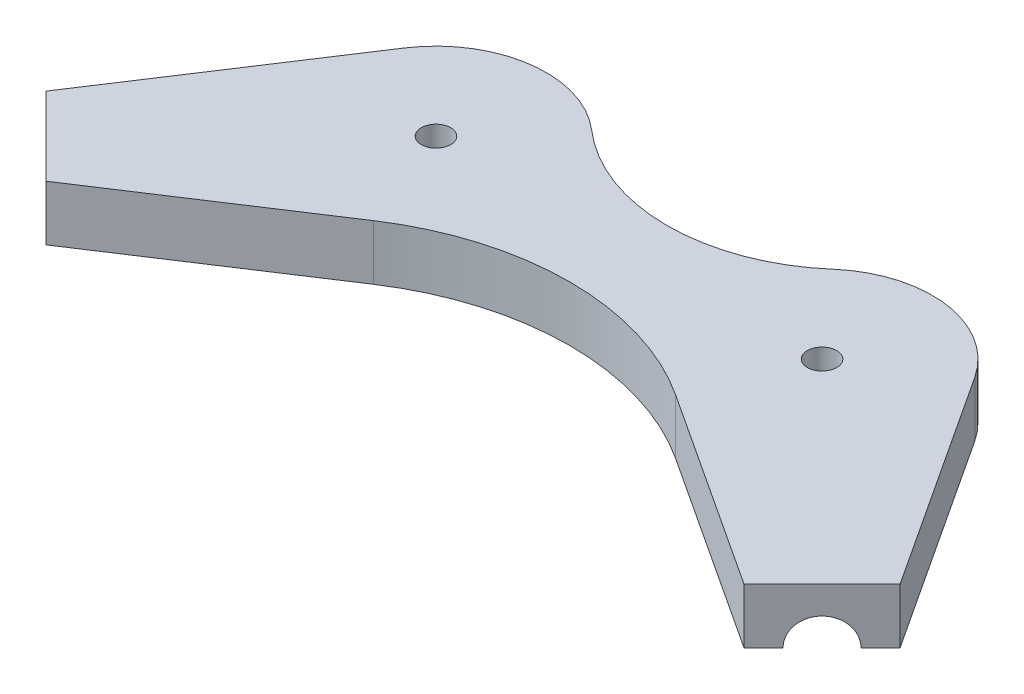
ISO-10303-21;
HEADER;
FILE_DESCRIPTION(('STEP AP214'),'2;1');
FILE_NAME('part.step','',(''),(''),'','','');
FILE_SCHEMA(('AUTOMOTIVE_DESIGN { 1 0 10303 214 1 1 1 1 }'));
ENDSEC;
DATA;
#1=APPLICATION_CONTEXT('core data for automotive mechanical design processes');
#2=APPLICATION_PROTOCOL_DEFINITION('international standard','automotive_design',2000,#1);
#3=PRODUCT_CONTEXT('',#1,'mechanical');
#4=PRODUCT('Part','Part','',(#3));
#5=PRODUCT_RELATED_PRODUCT_CATEGORY('part','',(#4));
#6=PRODUCT_DEFINITION_FORMATION('','',#4);
#7=PRODUCT_DEFINITION_CONTEXT('part definition',#1,'design');
#8=PRODUCT_DEFINITION('design','',#6,#7);
#9=PRODUCT_DEFINITION_SHAPE('','',#8);
#10=(LENGTH_UNIT() NAMED_UNIT(*) SI_UNIT(.MILLI.,.METRE.));
#11=(NAMED_UNIT(*) PLANE_ANGLE_UNIT() SI_UNIT($,.RADIAN.));
#12=(NAMED_UNIT(*) SI_UNIT($,.STERADIAN.) SOLID_ANGLE_UNIT());
#13=UNCERTAINTY_MEASURE_WITH_UNIT(LENGTH_MEASURE(1.E-05),#10,'distance_accuracy_value','');
#14=(GEOMETRIC_REPRESENTATION_CONTEXT(3) GLOBAL_UNCERTAINTY_ASSIGNED_CONTEXT((#13)) GLOBAL_UNIT_ASSIGNED_CONTEXT((#10,
#11,#12)) REPRESENTATION_CONTEXT('',''));
#15=CARTESIAN_POINT('',(0.,0.,0.));
#16=DIRECTION('',(0.,0.,1.));
#17=DIRECTION('',(1.,0.,0.));
#18=AXIS2_PLACEMENT_3D('',#15,#16,#17);
#19=CARTESIAN_POINT('',(21514.2246030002,15.,-4546.62679688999));
#20=DIRECTION('',(0.,1.,0.));
#21=DIRECTION('',(0.,0.,1.));
#22=AXIS2_PLACEMENT_3D('',#19,#20,#21);
#23=PLANE('',#22);
#24=CARTESIAN_POINT('',(21461.7246030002,15.,-4486.26331455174));
#25=DIRECTION('',(0.,1.,0.));
#26=DIRECTION('',(0.,0.,1.));
#27=AXIS2_PLACEMENT_3D('',#24,#25,#26);
#28=CIRCLE('',#27,4.00000000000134);
#29=CARTESIAN_POINT('',(21461.7246030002,15.,-4482.26331455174));
#30=VERTEX_POINT('',#29);
#31=EDGE_CURVE('E170',#30,#30,#28,.T.);
#32=ORIENTED_EDGE('',*,*,#31,.F.);
#33=EDGE_LOOP('',(#32));
#34=FACE_BOUND('',#33,.T.);
#35=CARTESIAN_POINT('',(21514.2246030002,15.,-4546.62679688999));
#36=DIRECTION('',(0.,-1.,0.));
#37=DIRECTION('',(0.,0.,1.));
#38=AXIS2_PLACEMENT_3D('',#35,#36,#37);
#39=CIRCLE('',#38,50.0000000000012);
#40=CARTESIAN_POINT('',(21547.0371030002,15.,-4508.89962042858));
#41=VERTEX_POINT('',#40);
#42=CARTESIAN_POINT('',(21481.4121030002,15.,-4508.89962042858));
#43=VERTEX_POINT('',#42);
#44=EDGE_CURVE('E176',#41,#43,#39,.T.);
#45=ORIENTED_EDGE('',*,*,#44,.T.);
#46=CARTESIAN_POINT('',(21461.7246030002,15.,-4486.26331455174));
#47=DIRECTION('',(0.,1.,0.));
#48=DIRECTION('',(0.,0.,1.));
#49=AXIS2_PLACEMENT_3D('',#46,#47,#48);
#50=CIRCLE('',#49,30.0000000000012);
#51=CARTESIAN_POINT('',(21436.6263946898,15.,-4502.69742358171));
#52=VERTEX_POINT('',#51);
#53=EDGE_CURVE('E179',#43,#52,#50,.T.);
#54=ORIENTED_EDGE('',*,*,#53,.T.);
#55=DIRECTION('',(-0.547803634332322,0.,0.836606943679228));
#56=VECTOR('',#55,1.);
#57=CARTESIAN_POINT('',(21398.0849926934,15.,-4443.83690768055));
#58=LINE('',#57,#56);
#59=CARTESIAN_POINT('',(21398.0849926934,15.,-4443.83690768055));
#60=VERTEX_POINT('',#59);
#61=EDGE_CURVE('E182',#52,#60,#58,.T.);
#62=ORIENTED_EDGE('',*,*,#61,.T.);
#63=DIRECTION('',(0.707106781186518,0.,0.707106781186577));
#64=VECTOR('',#63,1.);
#65=CARTESIAN_POINT('',(21419.298196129,15.,-4422.62370424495));
#66=LINE('',#65,#64);
#67=CARTESIAN_POINT('',(21419.298196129,15.,-4422.62370424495));
#68=VERTEX_POINT('',#67);
#69=EDGE_CURVE('E184',#60,#68,#66,.T.);
#70=ORIENTED_EDGE('',*,*,#69,.T.);
#71=DIRECTION('',(0.836606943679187,0.,-0.547803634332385));
#72=VECTOR('',#71,1.);
#73=CARTESIAN_POINT('',(21419.298196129,15.,-4422.62370424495));
#74=LINE('',#73,#72);
#75=CARTESIAN_POINT('',(21473.1393304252,15.,-4457.87845471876));
#76=VERTEX_POINT('',#75);
#77=EDGE_CURVE('E186',#68,#76,#74,.T.);
#78=ORIENTED_EDGE('',*,*,#77,.T.);
#79=CARTESIAN_POINT('',(21514.2246030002,15.,-4395.13293394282));
#80=DIRECTION('',(0.,-1.,0.));
#81=DIRECTION('',(0.,0.,1.));
#82=AXIS2_PLACEMENT_3D('',#79,#80,#81);
#83=CIRCLE('',#82,75.0000000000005);
#84=CARTESIAN_POINT('',(21555.3098755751,15.,-4457.87845471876));
#85=VERTEX_POINT('',#84);
#86=EDGE_CURVE('E188',#76,#85,#83,.T.);
#87=ORIENTED_EDGE('',*,*,#86,.T.);
#88=DIRECTION('',(0.836606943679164,0.,0.54780363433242));
#89=VECTOR('',#88,1.);
#90=CARTESIAN_POINT('',(21609.1510098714,15.,-4422.62370424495));
#91=LINE('',#90,#89);
#92=CARTESIAN_POINT('',(21609.1510098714,15.,-4422.62370424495));
#93=VERTEX_POINT('',#92);
#94=EDGE_CURVE('E190',#85,#93,#91,.T.);
#95=ORIENTED_EDGE('',*,*,#94,.T.);
#96=DIRECTION('',(0.707106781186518,0.,-0.707106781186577));
#97=VECTOR('',#96,1.);
#98=CARTESIAN_POINT('',(21609.1510098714,15.,-4422.62370424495));
#99=LINE('',#98,#97);
#100=CARTESIAN_POINT('',(21630.364213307,15.,-4443.83690768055));
#101=VERTEX_POINT('',#100);
#102=EDGE_CURVE('E192',#93,#101,#99,.T.);
#103=ORIENTED_EDGE('',*,*,#102,.T.);
#104=DIRECTION('',(-0.547803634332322,0.,-0.836606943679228));
#105=VECTOR('',#104,1.);
#106=CARTESIAN_POINT('',(21630.364213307,15.,-4443.83690768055));
#107=LINE('',#106,#105);
#108=CARTESIAN_POINT('',(21591.8228113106,15.,-4502.69742358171));
#109=VERTEX_POINT('',#108);
#110=EDGE_CURVE('E194',#101,#109,#107,.T.);
#111=ORIENTED_EDGE('',*,*,#110,.T.);
#112=CARTESIAN_POINT('',(21566.7246030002,15.,-4486.26331455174));
#113=DIRECTION('',(0.,1.,0.));
#114=DIRECTION('',(0.,0.,1.));
#115=AXIS2_PLACEMENT_3D('',#112,#113,#114);
#116=CIRCLE('',#115,29.9999999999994);
#117=EDGE_CURVE('E196',#109,#41,#116,.T.);
#118=ORIENTED_EDGE('',*,*,#117,.T.);
#119=EDGE_LOOP('',(#45,#54,#62,#70,#78,#87,#95,#103,#111,#118));
#120=FACE_BOUND('',#119,.T.);
#121=CARTESIAN_POINT('',(21566.7246030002,15.,-4486.26331455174));
#122=DIRECTION('',(0.,1.,0.));
#123=DIRECTION('',(0.,0.,1.));
#124=AXIS2_PLACEMENT_3D('',#121,#122,#123);
#125=CIRCLE('',#124,4.00000000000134);
#126=CARTESIAN_POINT('',(21566.7246030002,15.,-4482.26331455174));
#127=VERTEX_POINT('',#126);
#128=EDGE_CURVE('E164',#127,#127,#125,.T.);
#129=ORIENTED_EDGE('',*,*,#128,.F.);
#130=EDGE_LOOP('',(#129));
#131=FACE_BOUND('',#130,.T.);
#132=ADVANCED_FACE('F35',(#34,#120,#131),#23,.T.);
#133=CARTESIAN_POINT('',(21514.2246030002,0.,-4546.62679688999));
#134=DIRECTION('',(0.,1.,0.));
#135=DIRECTION('',(0.,0.,1.));
#136=AXIS2_PLACEMENT_3D('',#133,#134,#135);
#137=PLANE('',#136);
#138=CARTESIAN_POINT('',(21461.7246030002,0.,-4486.26331455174));
#139=DIRECTION('',(0.,1.,0.));
#140=DIRECTION('',(0.,0.,1.));
#141=AXIS2_PLACEMENT_3D('',#138,#139,#140);
#142=CIRCLE('',#141,4.00000000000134);
#143=CARTESIAN_POINT('',(21461.7246030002,0.,-4482.26331455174));
#144=VERTEX_POINT('',#143);
#145=EDGE_CURVE('E167',#144,#144,#142,.T.);
#146=ORIENTED_EDGE('',*,*,#145,.T.);
#147=EDGE_LOOP('',(#146));
#148=FACE_BOUND('',#147,.T.);
#149=DIRECTION('',(0.707106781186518,0.,-0.707106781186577));
#150=VECTOR('',#149,1.);
#151=CARTESIAN_POINT('',(21602.4761493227,0.,-4458.37525056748));
#152=LINE('',#151,#150);
#153=CARTESIAN_POINT('',(21593.2411072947,0.,-4449.14020853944));
#154=VERTEX_POINT('',#153);
#155=CARTESIAN_POINT('',(21603.8477090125,0.,-4459.74681025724));
#156=VERTEX_POINT('',#155);
#157=EDGE_CURVE('E11',#154,#156,#152,.T.);
#158=ORIENTED_EDGE('',*,*,#157,.F.);
#159=DIRECTION('',(0.707106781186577,0.,0.707106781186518));
#160=VECTOR('',#159,1.);
#161=CARTESIAN_POINT('',(21593.2411072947,0.,-4449.14020853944));
#162=LINE('',#161,#160);
#163=CARTESIAN_POINT('',(21614.4543107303,0.,-4427.92700510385));
#164=VERTEX_POINT('',#163);
#165=EDGE_CURVE('E142',#154,#164,#162,.T.);
#166=ORIENTED_EDGE('',*,*,#165,.T.);
#167=DIRECTION('',(0.707106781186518,0.,-0.707106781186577));
#168=VECTOR('',#167,1.);
#169=CARTESIAN_POINT('',(21609.1510098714,0.,-4422.62370424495));
#170=LINE('',#169,#168);
#171=CARTESIAN_POINT('',(21609.1510098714,0.,-4422.62370424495));
#172=VERTEX_POINT('',#171);
#173=EDGE_CURVE('E215',#172,#164,#170,.T.);
#174=ORIENTED_EDGE('',*,*,#173,.F.);
#175=DIRECTION('',(0.836606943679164,0.,0.54780363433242));
#176=VECTOR('',#175,1.);
#177=CARTESIAN_POINT('',(21609.1510098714,0.,-4422.62370424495));
#178=LINE('',#177,#176);
#179=CARTESIAN_POINT('',(21555.3098755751,0.,-4457.87845471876));
#180=VERTEX_POINT('',#179);
#181=EDGE_CURVE('E213',#180,#172,#178,.T.);
#182=ORIENTED_EDGE('',*,*,#181,.F.);
#183=CARTESIAN_POINT('',(21514.2246030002,0.,-4395.13293394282));
#184=DIRECTION('',(0.,-1.,0.));
#185=DIRECTION('',(0.,0.,1.));
#186=AXIS2_PLACEMENT_3D('',#183,#184,#185);
#187=CIRCLE('',#186,75.0000000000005);
#188=CARTESIAN_POINT('',(21473.1393304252,0.,-4457.87845471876));
#189=VERTEX_POINT('',#188);
#190=EDGE_CURVE('E211',#189,#180,#187,.T.);
#191=ORIENTED_EDGE('',*,*,#190,.F.);
#192=DIRECTION('',(0.836606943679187,0.,-0.547803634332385));
#193=VECTOR('',#192,1.);
#194=CARTESIAN_POINT('',(21419.298196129,0.,-4422.62370424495));
#195=LINE('',#194,#193);
#196=CARTESIAN_POINT('',(21419.298196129,0.,-4422.62370424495));
#197=VERTEX_POINT('',#196);
#198=EDGE_CURVE('E209',#197,#189,#195,.T.);
#199=ORIENTED_EDGE('',*,*,#198,.F.);
#200=DIRECTION('',(0.707106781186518,0.,0.707106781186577));
#201=VECTOR('',#200,1.);
#202=CARTESIAN_POINT('',(21419.298196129,0.,-4422.62370424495));
#203=LINE('',#202,#201);
#204=CARTESIAN_POINT('',(21413.9948952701,0.,-4427.92700510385));
#205=VERTEX_POINT('',#204);
#206=EDGE_CURVE('E205',#205,#197,#203,.T.);
#207=ORIENTED_EDGE('',*,*,#206,.F.);
#208=DIRECTION('',(-0.707106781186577,0.,0.707106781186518));
#209=VECTOR('',#208,1.);
#210=CARTESIAN_POINT('',(21435.2080987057,0.,-4449.14020853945));
#211=LINE('',#210,#209);
#212=CARTESIAN_POINT('',(21435.2080987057,0.,-4449.14020853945));
#213=VERTEX_POINT('',#212);
#214=EDGE_CURVE('E58',#205,#213,#211,.F.);
#215=ORIENTED_EDGE('',*,*,#214,.T.);
#216=DIRECTION('',(0.707106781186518,0.,0.707106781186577));
#217=VECTOR('',#216,1.);
#218=CARTESIAN_POINT('',(21425.9730566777,0.,-4458.37525056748));
#219=LINE('',#218,#217);
#220=CARTESIAN_POINT('',(21424.6014969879,0.,-4459.74681025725));
#221=VERTEX_POINT('',#220);
#222=EDGE_CURVE('E43',#221,#213,#219,.T.);
#223=ORIENTED_EDGE('',*,*,#222,.F.);
#224=DIRECTION('',(-0.707106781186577,0.,0.707106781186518));
#225=VECTOR('',#224,1.);
#226=CARTESIAN_POINT('',(21424.6014969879,0.,-4459.74681025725));
#227=LINE('',#226,#225);
#228=CARTESIAN_POINT('',(21403.3882935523,0.,-4438.53360682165));
#229=VERTEX_POINT('',#228);
#230=EDGE_CURVE('E160',#221,#229,#227,.T.);
#231=ORIENTED_EDGE('',*,*,#230,.T.);
#232=CARTESIAN_POINT('',(21398.0849926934,0.,-4443.83690768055));
#233=VERTEX_POINT('',#232);
#234=EDGE_CURVE('E206',#233,#229,#203,.T.);
#235=ORIENTED_EDGE('',*,*,#234,.F.);
#236=DIRECTION('',(-0.547803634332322,0.,0.836606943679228));
#237=VECTOR('',#236,1.);
#238=CARTESIAN_POINT('',(21398.0849926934,0.,-4443.83690768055));
#239=LINE('',#238,#237);
#240=CARTESIAN_POINT('',(21436.6263946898,0.,-4502.69742358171));
#241=VERTEX_POINT('',#240);
#242=EDGE_CURVE('E203',#241,#233,#239,.T.);
#243=ORIENTED_EDGE('',*,*,#242,.F.);
#244=CARTESIAN_POINT('',(21461.7246030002,0.,-4486.26331455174));
#245=DIRECTION('',(0.,1.,0.));
#246=DIRECTION('',(0.,0.,1.));
#247=AXIS2_PLACEMENT_3D('',#244,#245,#246);
#248=CIRCLE('',#247,30.0000000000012);
#249=CARTESIAN_POINT('',(21481.4121030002,0.,-4508.89962042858));
#250=VERTEX_POINT('',#249);
#251=EDGE_CURVE('E201',#250,#241,#248,.T.);
#252=ORIENTED_EDGE('',*,*,#251,.F.);
#253=CARTESIAN_POINT('',(21514.2246030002,0.,-4546.62679688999));
#254=DIRECTION('',(0.,-1.,0.));
#255=DIRECTION('',(0.,0.,1.));
#256=AXIS2_PLACEMENT_3D('',#253,#254,#255);
#257=CIRCLE('',#256,50.0000000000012);
#258=CARTESIAN_POINT('',(21547.0371030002,0.,-4508.89962042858));
#259=VERTEX_POINT('',#258);
#260=EDGE_CURVE('E173',#259,#250,#257,.T.);
#261=ORIENTED_EDGE('',*,*,#260,.F.);
#262=CARTESIAN_POINT('',(21566.7246030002,0.,-4486.26331455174));
#263=DIRECTION('',(0.,1.,0.));
#264=DIRECTION('',(0.,0.,1.));
#265=AXIS2_PLACEMENT_3D('',#262,#263,#264);
#266=CIRCLE('',#265,29.9999999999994);
#267=CARTESIAN_POINT('',(21591.8228113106,0.,-4502.69742358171));
#268=VERTEX_POINT('',#267);
#269=EDGE_CURVE('E180',#268,#259,#266,.T.);
#270=ORIENTED_EDGE('',*,*,#269,.F.);
#271=DIRECTION('',(-0.547803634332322,0.,-0.836606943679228));
#272=VECTOR('',#271,1.);
#273=CARTESIAN_POINT('',(21630.364213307,0.,-4443.83690768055));
#274=LINE('',#273,#272);
#275=CARTESIAN_POINT('',(21630.364213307,0.,-4443.83690768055));
#276=VERTEX_POINT('',#275);
#277=EDGE_CURVE('E218',#276,#268,#274,.T.);
#278=ORIENTED_EDGE('',*,*,#277,.F.);
#279=CARTESIAN_POINT('',(21625.0609124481,0.,-4438.53360682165));
#280=VERTEX_POINT('',#279);
#281=EDGE_CURVE('E149',#280,#276,#170,.T.);
#282=ORIENTED_EDGE('',*,*,#281,.F.);
#283=DIRECTION('',(0.707106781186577,0.,0.707106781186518));
#284=VECTOR('',#283,1.);
#285=CARTESIAN_POINT('',(21603.8477090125,0.,-4459.74681025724));
#286=LINE('',#285,#284);
#287=EDGE_CURVE('E50',#280,#156,#286,.F.);
#288=ORIENTED_EDGE('',*,*,#287,.T.);
#289=EDGE_LOOP('',(#158,#166,#174,#182,#191,#199,#207,#215,#223,#231,#235,#243,#252,#261,#270,
#278,#282,#288));
#290=FACE_BOUND('',#289,.T.);
#291=CARTESIAN_POINT('',(21566.7246030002,0.,-4486.26331455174));
#292=DIRECTION('',(0.,1.,0.));
#293=DIRECTION('',(0.,0.,1.));
#294=AXIS2_PLACEMENT_3D('',#291,#292,#293);
#295=CIRCLE('',#294,4.00000000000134);
#296=CARTESIAN_POINT('',(21566.7246030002,0.,-4482.26331455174));
#297=VERTEX_POINT('',#296);
#298=EDGE_CURVE('E163',#297,#297,#295,.T.);
#299=ORIENTED_EDGE('',*,*,#298,.T.);
#300=EDGE_LOOP('',(#299));
#301=FACE_BOUND('',#300,.T.);
#302=ADVANCED_FACE('F146',(#148,#290,#301),#137,.F.);
#303=CARTESIAN_POINT('',(21514.2246030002,15.,-4546.62679688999));
#304=DIRECTION('',(0.,-1.,0.));
#305=DIRECTION('',(0.,0.,-1.));
#306=AXIS2_PLACEMENT_3D('',#303,#304,#305);
#307=CYLINDRICAL_SURFACE('',#306,50.0000000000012);
#308=ORIENTED_EDGE('',*,*,#260,.T.);
#309=DIRECTION('',(0.,-1.,0.));
#310=VECTOR('',#309,1.);
#311=CARTESIAN_POINT('',(21481.4121030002,15.,-4508.89962042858));
#312=LINE('',#311,#310);
#313=EDGE_CURVE('E247',#43,#250,#312,.T.);
#314=ORIENTED_EDGE('',*,*,#313,.F.);
#315=ORIENTED_EDGE('',*,*,#44,.F.);
#316=DIRECTION('',(0.,-1.,0.));
#317=VECTOR('',#316,1.);
#318=CARTESIAN_POINT('',(21547.0371030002,15.,-4508.89962042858));
#319=LINE('',#318,#317);
#320=EDGE_CURVE('E198',#41,#259,#319,.T.);
#321=ORIENTED_EDGE('',*,*,#320,.T.);
#322=EDGE_LOOP('',(#308,#314,#315,#321));
#323=FACE_BOUND('',#322,.T.);
#324=ADVANCED_FACE('F37',(#323),#307,.F.);
#325=CARTESIAN_POINT('',(21461.7246030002,15.,-4486.26331455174));
#326=DIRECTION('',(0.,-1.,0.));
#327=DIRECTION('',(0.,0.,-1.));
#328=AXIS2_PLACEMENT_3D('',#325,#326,#327);
#329=CYLINDRICAL_SURFACE('',#328,30.0000000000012);
#330=ORIENTED_EDGE('',*,*,#251,.T.);
#331=DIRECTION('',(0.,-1.,0.));
#332=VECTOR('',#331,1.);
#333=CARTESIAN_POINT('',(21436.6263946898,15.,-4502.69742358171));
#334=LINE('',#333,#332);
#335=EDGE_CURVE('E244',#52,#241,#334,.T.);
#336=ORIENTED_EDGE('',*,*,#335,.F.);
#337=ORIENTED_EDGE('',*,*,#53,.F.);
#338=ORIENTED_EDGE('',*,*,#313,.T.);
#339=EDGE_LOOP('',(#330,#336,#337,#338));
#340=FACE_BOUND('',#339,.T.);
#341=ADVANCED_FACE('F277',(#340),#329,.T.);
#342=CARTESIAN_POINT('',(21398.0849926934,15.,-4443.83690768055));
#343=DIRECTION('',(0.836606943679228,0.,0.547803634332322));
#344=DIRECTION('',(0.547803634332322,0.,-0.836606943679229));
#345=AXIS2_PLACEMENT_3D('',#342,#343,#344);
#346=PLANE('',#345);
#347=ORIENTED_EDGE('',*,*,#242,.T.);
#348=DIRECTION('',(0.,-1.,0.));
#349=VECTOR('',#348,1.);
#350=CARTESIAN_POINT('',(21398.0849926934,15.,-4443.83690768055));
#351=LINE('',#350,#349);
#352=EDGE_CURVE('E241',#60,#233,#351,.T.);
#353=ORIENTED_EDGE('',*,*,#352,.F.);
#354=ORIENTED_EDGE('',*,*,#61,.F.);
#355=ORIENTED_EDGE('',*,*,#335,.T.);
#356=EDGE_LOOP('',(#347,#353,#354,#355));
#357=FACE_BOUND('',#356,.T.);
#358=ADVANCED_FACE('F274',(#357),#346,.F.);
#359=CARTESIAN_POINT('',(21419.298196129,15.,-4422.62370424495));
#360=DIRECTION('',(0.707106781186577,0.,-0.707106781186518));
#361=DIRECTION('',(-0.707106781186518,0.,-0.707106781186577));
#362=AXIS2_PLACEMENT_3D('',#359,#360,#361);
#363=PLANE('',#362);
#364=ORIENTED_EDGE('',*,*,#234,.T.);
#365=CARTESIAN_POINT('',(21408.6915944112,0.,-4433.23030596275));
#366=DIRECTION('',(-0.707106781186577,0.,0.707106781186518));
#367=DIRECTION('',(0.707106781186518,0.,0.707106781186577));
#368=AXIS2_PLACEMENT_3D('',#365,#366,#367);
#369=CIRCLE('',#368,7.50000000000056);
#370=EDGE_CURVE('E151',#205,#229,#369,.T.);
#371=ORIENTED_EDGE('',*,*,#370,.F.);
#372=ORIENTED_EDGE('',*,*,#206,.T.);
#373=DIRECTION('',(0.,-1.,0.));
#374=VECTOR('',#373,1.);
#375=CARTESIAN_POINT('',(21419.298196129,15.,-4422.62370424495));
#376=LINE('',#375,#374);
#377=EDGE_CURVE('E238',#68,#197,#376,.T.);
#378=ORIENTED_EDGE('',*,*,#377,.F.);
#379=ORIENTED_EDGE('',*,*,#69,.F.);
#380=ORIENTED_EDGE('',*,*,#352,.T.);
#381=EDGE_LOOP('',(#364,#371,#372,#378,#379,#380));
#382=FACE_BOUND('',#381,.T.);
#383=ADVANCED_FACE('F258',(#382),#363,.F.);
#384=CARTESIAN_POINT('',(21419.298196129,15.,-4422.62370424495));
#385=DIRECTION('',(-0.547803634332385,0.,-0.836606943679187));
#386=DIRECTION('',(-0.836606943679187,0.,0.547803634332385));
#387=AXIS2_PLACEMENT_3D('',#384,#385,#386);
#388=PLANE('',#387);
#389=ORIENTED_EDGE('',*,*,#198,.T.);
#390=DIRECTION('',(0.,-1.,0.));
#391=VECTOR('',#390,1.);
#392=CARTESIAN_POINT('',(21473.1393304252,15.,-4457.87845471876));
#393=LINE('',#392,#391);
#394=EDGE_CURVE('E235',#76,#189,#393,.T.);
#395=ORIENTED_EDGE('',*,*,#394,.F.);
#396=ORIENTED_EDGE('',*,*,#77,.F.);
#397=ORIENTED_EDGE('',*,*,#377,.T.);
#398=EDGE_LOOP('',(#389,#395,#396,#397));
#399=FACE_BOUND('',#398,.T.);
#400=ADVANCED_FACE('F262',(#399),#388,.F.);
#401=CARTESIAN_POINT('',(21514.2246030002,15.,-4395.13293394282));
#402=DIRECTION('',(0.,-1.,0.));
#403=DIRECTION('',(0.,0.,-1.));
#404=AXIS2_PLACEMENT_3D('',#401,#402,#403);
#405=CYLINDRICAL_SURFACE('',#404,75.0000000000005);
#406=ORIENTED_EDGE('',*,*,#190,.T.);
#407=DIRECTION('',(0.,-1.,0.));
#408=VECTOR('',#407,1.);
#409=CARTESIAN_POINT('',(21555.3098755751,15.,-4457.87845471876));
#410=LINE('',#409,#408);
#411=EDGE_CURVE('E232',#85,#180,#410,.T.);
#412=ORIENTED_EDGE('',*,*,#411,.F.);
#413=ORIENTED_EDGE('',*,*,#86,.F.);
#414=ORIENTED_EDGE('',*,*,#394,.T.);
#415=EDGE_LOOP('',(#406,#412,#413,#414));
#416=FACE_BOUND('',#415,.T.);
#417=ADVANCED_FACE('F301',(#416),#405,.F.);
#418=CARTESIAN_POINT('',(21609.1510098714,15.,-4422.62370424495));
#419=DIRECTION('',(0.54780363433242,0.,-0.836606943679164));
#420=DIRECTION('',(-0.836606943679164,0.,-0.54780363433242));
#421=AXIS2_PLACEMENT_3D('',#418,#419,#420);
#422=PLANE('',#421);
#423=ORIENTED_EDGE('',*,*,#181,.T.);
#424=DIRECTION('',(0.,-1.,0.));
#425=VECTOR('',#424,1.);
#426=CARTESIAN_POINT('',(21609.1510098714,15.,-4422.62370424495));
#427=LINE('',#426,#425);
#428=EDGE_CURVE('E229',#93,#172,#427,.T.);
#429=ORIENTED_EDGE('',*,*,#428,.F.);
#430=ORIENTED_EDGE('',*,*,#94,.F.);
#431=ORIENTED_EDGE('',*,*,#411,.T.);
#432=EDGE_LOOP('',(#423,#429,#430,#431));
#433=FACE_BOUND('',#432,.T.);
#434=ADVANCED_FACE('F298',(#433),#422,.F.);
#435=CARTESIAN_POINT('',(21609.1510098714,15.,-4422.62370424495));
#436=DIRECTION('',(-0.707106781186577,0.,-0.707106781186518));
#437=DIRECTION('',(-0.707106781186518,0.,0.707106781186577));
#438=AXIS2_PLACEMENT_3D('',#435,#436,#437);
#439=PLANE('',#438);
#440=ORIENTED_EDGE('',*,*,#173,.T.);
#441=CARTESIAN_POINT('',(21619.7576115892,0.,-4433.23030596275));
#442=DIRECTION('',(0.707106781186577,0.,0.707106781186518));
#443=DIRECTION('',(0.707106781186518,0.,-0.707106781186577));
#444=AXIS2_PLACEMENT_3D('',#441,#442,#443);
#445=CIRCLE('',#444,7.49999999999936);
#446=EDGE_CURVE('E143',#280,#164,#445,.T.);
#447=ORIENTED_EDGE('',*,*,#446,.F.);
#448=ORIENTED_EDGE('',*,*,#281,.T.);
#449=DIRECTION('',(0.,-1.,0.));
#450=VECTOR('',#449,1.);
#451=CARTESIAN_POINT('',(21630.364213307,15.,-4443.83690768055));
#452=LINE('',#451,#450);
#453=EDGE_CURVE('E226',#101,#276,#452,.T.);
#454=ORIENTED_EDGE('',*,*,#453,.F.);
#455=ORIENTED_EDGE('',*,*,#102,.F.);
#456=ORIENTED_EDGE('',*,*,#428,.T.);
#457=EDGE_LOOP('',(#440,#447,#448,#454,#455,#456));
#458=FACE_BOUND('',#457,.T.);
#459=ADVANCED_FACE('F293',(#458),#439,.F.);
#460=CARTESIAN_POINT('',(21630.364213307,15.,-4443.83690768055));
#461=DIRECTION('',(-0.836606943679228,0.,0.547803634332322));
#462=DIRECTION('',(0.547803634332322,0.,0.836606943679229));
#463=AXIS2_PLACEMENT_3D('',#460,#461,#462);
#464=PLANE('',#463);
#465=ORIENTED_EDGE('',*,*,#277,.T.);
#466=DIRECTION('',(0.,-1.,0.));
#467=VECTOR('',#466,1.);
#468=CARTESIAN_POINT('',(21591.8228113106,15.,-4502.69742358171));
#469=LINE('',#468,#467);
#470=EDGE_CURVE('E223',#109,#268,#469,.T.);
#471=ORIENTED_EDGE('',*,*,#470,.F.);
#472=ORIENTED_EDGE('',*,*,#110,.F.);
#473=ORIENTED_EDGE('',*,*,#453,.T.);
#474=EDGE_LOOP('',(#465,#471,#472,#473));
#475=FACE_BOUND('',#474,.T.);
#476=ADVANCED_FACE('F289',(#475),#464,.F.);
#477=CARTESIAN_POINT('',(21566.7246030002,15.,-4486.26331455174));
#478=DIRECTION('',(0.,-1.,0.));
#479=DIRECTION('',(0.,0.,-1.));
#480=AXIS2_PLACEMENT_3D('',#477,#478,#479);
#481=CYLINDRICAL_SURFACE('',#480,29.9999999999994);
#482=ORIENTED_EDGE('',*,*,#269,.T.);
#483=ORIENTED_EDGE('',*,*,#320,.F.);
#484=ORIENTED_EDGE('',*,*,#117,.F.);
#485=ORIENTED_EDGE('',*,*,#470,.T.);
#486=EDGE_LOOP('',(#482,#483,#484,#485));
#487=FACE_BOUND('',#486,.T.);
#488=ADVANCED_FACE('F284',(#487),#481,.T.);
#489=CARTESIAN_POINT('',(21461.7246030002,15.,-4486.26331455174));
#490=DIRECTION('',(0.,-1.,0.));
#491=DIRECTION('',(0.,0.,-1.));
#492=AXIS2_PLACEMENT_3D('',#489,#490,#491);
#493=CYLINDRICAL_SURFACE('',#492,4.00000000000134);
#494=ORIENTED_EDGE('',*,*,#31,.T.);
#495=EDGE_LOOP('',(#494));
#496=FACE_BOUND('',#495,.T.);
#497=ORIENTED_EDGE('',*,*,#145,.F.);
#498=EDGE_LOOP('',(#497));
#499=FACE_BOUND('',#498,.T.);
#500=ADVANCED_FACE('F321',(#496,#499),#493,.F.);
#501=CARTESIAN_POINT('',(21566.7246030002,15.,-4486.26331455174));
#502=DIRECTION('',(0.,-1.,0.));
#503=DIRECTION('',(0.,0.,-1.));
#504=AXIS2_PLACEMENT_3D('',#501,#502,#503);
#505=CYLINDRICAL_SURFACE('',#504,4.00000000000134);
#506=ORIENTED_EDGE('',*,*,#128,.T.);
#507=EDGE_LOOP('',(#506));
#508=FACE_BOUND('',#507,.T.);
#509=ORIENTED_EDGE('',*,*,#298,.F.);
#510=EDGE_LOOP('',(#509));
#511=FACE_BOUND('',#510,.T.);
#512=ADVANCED_FACE('F356',(#508,#511),#505,.F.);
#513=CARTESIAN_POINT('',(21429.9047978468,0.,-4454.44350939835));
#514=DIRECTION('',(-0.707106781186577,0.,0.707106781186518));
#515=DIRECTION('',(0.707106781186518,0.,0.707106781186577));
#516=AXIS2_PLACEMENT_3D('',#513,#514,#515);
#517=PLANE('',#516);
#518=ORIENTED_EDGE('',*,*,#222,.T.);
#519=CARTESIAN_POINT('',(21429.9047978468,0.,-4454.44350939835));
#520=DIRECTION('',(-0.707106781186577,0.,0.707106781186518));
#521=DIRECTION('',(0.707106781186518,0.,0.707106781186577));
#522=AXIS2_PLACEMENT_3D('',#519,#520,#521);
#523=CIRCLE('',#522,7.50000000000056);
#524=EDGE_CURVE('E155',#213,#221,#523,.T.);
#525=ORIENTED_EDGE('',*,*,#524,.T.);
#526=EDGE_LOOP('',(#518,#525));
#527=FACE_BOUND('',#526,.T.);
#528=ADVANCED_FACE('F251',(#527),#517,.T.);
#529=CARTESIAN_POINT('',(21429.9047978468,0.,-4454.44350939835));
#530=DIRECTION('',(-0.707106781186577,0.,0.707106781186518));
#531=DIRECTION('',(0.707106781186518,0.,0.707106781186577));
#532=AXIS2_PLACEMENT_3D('',#529,#530,#531);
#533=CYLINDRICAL_SURFACE('',#532,7.50000000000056);
#534=ORIENTED_EDGE('',*,*,#524,.F.);
#535=ORIENTED_EDGE('',*,*,#214,.F.);
#536=ORIENTED_EDGE('',*,*,#370,.T.);
#537=ORIENTED_EDGE('',*,*,#230,.F.);
#538=EDGE_LOOP('',(#534,#535,#536,#537));
#539=FACE_BOUND('',#538,.T.);
#540=ADVANCED_FACE('F252',(#539),#533,.F.);
#541=CARTESIAN_POINT('',(21598.5444081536,0.,-4454.44350939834));
#542=DIRECTION('',(0.707106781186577,0.,0.707106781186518));
#543=DIRECTION('',(0.707106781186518,0.,-0.707106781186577));
#544=AXIS2_PLACEMENT_3D('',#541,#542,#543);
#545=PLANE('',#544);
#546=ORIENTED_EDGE('',*,*,#157,.T.);
#547=CARTESIAN_POINT('',(21598.5444081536,0.,-4454.44350939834));
#548=DIRECTION('',(0.707106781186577,0.,0.707106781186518));
#549=DIRECTION('',(0.707106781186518,0.,-0.707106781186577));
#550=AXIS2_PLACEMENT_3D('',#547,#548,#549);
#551=CIRCLE('',#550,7.49999999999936);
#552=EDGE_CURVE('E138',#156,#154,#551,.T.);
#553=ORIENTED_EDGE('',*,*,#552,.T.);
#554=EDGE_LOOP('',(#546,#553));
#555=FACE_BOUND('',#554,.T.);
#556=ADVANCED_FACE('F137',(#555),#545,.T.);
#557=CARTESIAN_POINT('',(21598.5444081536,0.,-4454.44350939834));
#558=DIRECTION('',(0.707106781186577,0.,0.707106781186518));
#559=DIRECTION('',(0.707106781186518,0.,-0.707106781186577));
#560=AXIS2_PLACEMENT_3D('',#557,#558,#559);
#561=CYLINDRICAL_SURFACE('',#560,7.49999999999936);
#562=ORIENTED_EDGE('',*,*,#552,.F.);
#563=ORIENTED_EDGE('',*,*,#287,.F.);
#564=ORIENTED_EDGE('',*,*,#446,.T.);
#565=ORIENTED_EDGE('',*,*,#165,.F.);
#566=EDGE_LOOP('',(#562,#563,#564,#565));
#567=FACE_BOUND('',#566,.T.);
#568=ADVANCED_FACE('F141',(#567),#561,.F.);
#569=CLOSED_SHELL('',(#132,#302,#324,#341,#358,#383,#400,#417,#434,#459,#476,#488,#500,#512,
#528,#540,#556,#568));
#570=MANIFOLD_SOLID_BREP('B2',#569);
#571=ADVANCED_BREP_SHAPE_REPRESENTATION('',(#18,#570),#14);
#572=SHAPE_DEFINITION_REPRESENTATION(#9,#571);
ENDSEC;
END-ISO-10303-21;
